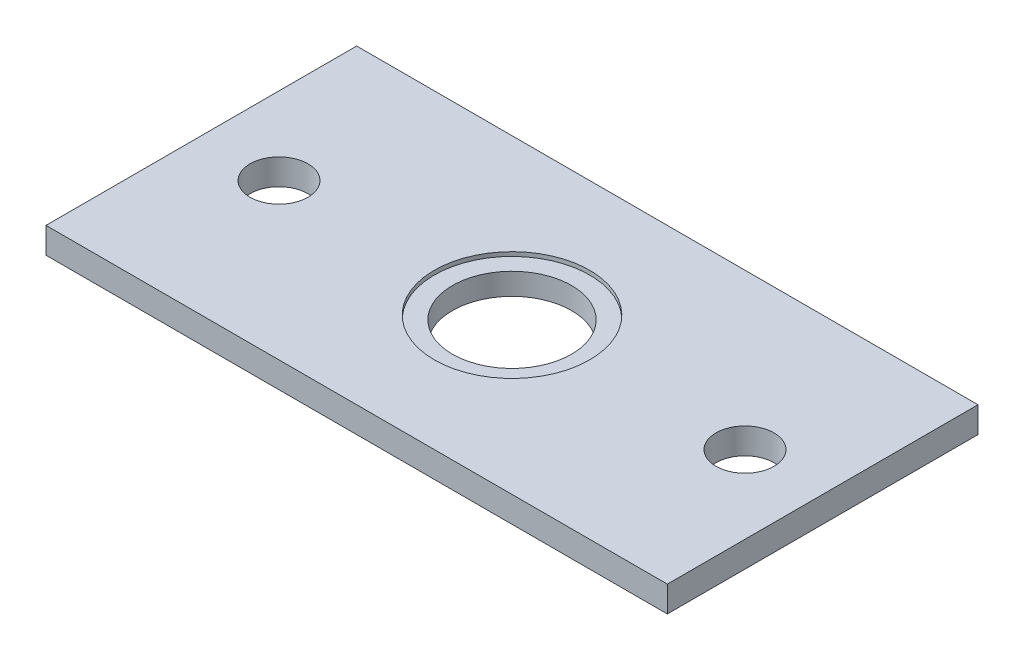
ISO-10303-21;
HEADER;
FILE_DESCRIPTION(('STEP AP214'),'2;1');
FILE_NAME('part.step','',(''),(''),'','','');
FILE_SCHEMA(('AUTOMOTIVE_DESIGN { 1 0 10303 214 1 1 1 1 }'));
ENDSEC;
DATA;
#1=APPLICATION_CONTEXT('core data for automotive mechanical design processes');
#2=APPLICATION_PROTOCOL_DEFINITION('international standard','automotive_design',2000,#1);
#3=PRODUCT_CONTEXT('',#1,'mechanical');
#4=PRODUCT('Part','Part','',(#3));
#5=PRODUCT_RELATED_PRODUCT_CATEGORY('part','',(#4));
#6=PRODUCT_DEFINITION_FORMATION('','',#4);
#7=PRODUCT_DEFINITION_CONTEXT('part definition',#1,'design');
#8=PRODUCT_DEFINITION('design','',#6,#7);
#9=PRODUCT_DEFINITION_SHAPE('','',#8);
#10=(LENGTH_UNIT() NAMED_UNIT(*) SI_UNIT(.MILLI.,.METRE.));
#11=(NAMED_UNIT(*) PLANE_ANGLE_UNIT() SI_UNIT($,.RADIAN.));
#12=(NAMED_UNIT(*) SI_UNIT($,.STERADIAN.) SOLID_ANGLE_UNIT());
#13=UNCERTAINTY_MEASURE_WITH_UNIT(LENGTH_MEASURE(1.E-05),#10,'distance_accuracy_value','');
#14=(GEOMETRIC_REPRESENTATION_CONTEXT(3) GLOBAL_UNCERTAINTY_ASSIGNED_CONTEXT((#13)) GLOBAL_UNIT_ASSIGNED_CONTEXT((#10,
#11,#12)) REPRESENTATION_CONTEXT('',''));
#15=CARTESIAN_POINT('',(0.,0.,0.));
#16=DIRECTION('',(0.,0.,1.));
#17=DIRECTION('',(1.,0.,0.));
#18=AXIS2_PLACEMENT_3D('',#15,#16,#17);
#19=CARTESIAN_POINT('',(38.1,0.,-19.05));
#20=DIRECTION('',(0.,1.,0.));
#21=DIRECTION('',(0.,0.,1.));
#22=AXIS2_PLACEMENT_3D('',#19,#20,#21);
#23=CYLINDRICAL_SURFACE('',#22,7.3025);
#24=CARTESIAN_POINT('',(38.1,0.,-19.05));
#25=DIRECTION('',(0.,1.,0.));
#26=DIRECTION('',(0.,0.,1.));
#27=AXIS2_PLACEMENT_3D('',#24,#25,#26);
#28=CIRCLE('',#27,7.3025);
#29=CARTESIAN_POINT('',(38.1,0.,-11.7475));
#30=VERTEX_POINT('',#29);
#31=EDGE_CURVE('E101',#30,#30,#28,.T.);
#32=ORIENTED_EDGE('',*,*,#31,.F.);
#33=EDGE_LOOP('',(#32));
#34=FACE_BOUND('',#33,.T.);
#35=CARTESIAN_POINT('',(38.1,2.667,-19.05));
#36=DIRECTION('',(0.,1.,0.));
#37=DIRECTION('',(0.,0.,1.));
#38=AXIS2_PLACEMENT_3D('',#35,#36,#37);
#39=CIRCLE('',#38,7.3025);
#40=CARTESIAN_POINT('',(38.1,2.667,-11.7475));
#41=VERTEX_POINT('',#40);
#42=EDGE_CURVE('E36',#41,#41,#39,.F.);
#43=ORIENTED_EDGE('',*,*,#42,.F.);
#44=EDGE_LOOP('',(#43));
#45=FACE_BOUND('',#44,.T.);
#46=ADVANCED_FACE('F32',(#34,#45),#23,.F.);
#47=CARTESIAN_POINT('',(0.,3.175,0.));
#48=DIRECTION('',(1.,0.,0.));
#49=DIRECTION('',(0.,0.,-1.));
#50=AXIS2_PLACEMENT_3D('',#47,#48,#49);
#51=PLANE('',#50);
#52=DIRECTION('',(0.,0.,1.));
#53=VECTOR('',#52,1.);
#54=CARTESIAN_POINT('',(0.,0.,0.));
#55=LINE('',#54,#53);
#56=CARTESIAN_POINT('',(0.,0.,-38.1));
#57=VERTEX_POINT('',#56);
#58=CARTESIAN_POINT('',(0.,0.,0.));
#59=VERTEX_POINT('',#58);
#60=EDGE_CURVE('E98',#57,#59,#55,.T.);
#61=ORIENTED_EDGE('',*,*,#60,.T.);
#62=DIRECTION('',(0.,-1.,0.));
#63=VECTOR('',#62,1.);
#64=CARTESIAN_POINT('',(0.,3.175,0.));
#65=LINE('',#64,#63);
#66=CARTESIAN_POINT('',(0.,3.175,0.));
#67=VERTEX_POINT('',#66);
#68=EDGE_CURVE('E11',#67,#59,#65,.T.);
#69=ORIENTED_EDGE('',*,*,#68,.F.);
#70=DIRECTION('',(0.,0.,1.));
#71=VECTOR('',#70,1.);
#72=CARTESIAN_POINT('',(0.,3.175,0.));
#73=LINE('',#72,#71);
#74=CARTESIAN_POINT('',(0.,3.175,-38.1));
#75=VERTEX_POINT('',#74);
#76=EDGE_CURVE('E85',#75,#67,#73,.T.);
#77=ORIENTED_EDGE('',*,*,#76,.F.);
#78=DIRECTION('',(0.,-1.,0.));
#79=VECTOR('',#78,1.);
#80=CARTESIAN_POINT('',(0.,3.175,-38.1));
#81=LINE('',#80,#79);
#82=EDGE_CURVE('E94',#75,#57,#81,.T.);
#83=ORIENTED_EDGE('',*,*,#82,.T.);
#84=EDGE_LOOP('',(#61,#69,#77,#83));
#85=FACE_BOUND('',#84,.T.);
#86=ADVANCED_FACE('F34',(#85),#51,.F.);
#87=CARTESIAN_POINT('',(0.,3.175,0.));
#88=DIRECTION('',(0.,0.,-1.));
#89=DIRECTION('',(-1.,0.,0.));
#90=AXIS2_PLACEMENT_3D('',#87,#88,#89);
#91=PLANE('',#90);
#92=DIRECTION('',(1.,0.,0.));
#93=VECTOR('',#92,1.);
#94=CARTESIAN_POINT('',(0.,0.,0.));
#95=LINE('',#94,#93);
#96=CARTESIAN_POINT('',(76.2,0.,0.));
#97=VERTEX_POINT('',#96);
#98=EDGE_CURVE('E89',#59,#97,#95,.T.);
#99=ORIENTED_EDGE('',*,*,#98,.T.);
#100=DIRECTION('',(0.,-1.,0.));
#101=VECTOR('',#100,1.);
#102=CARTESIAN_POINT('',(76.2,3.175,0.));
#103=LINE('',#102,#101);
#104=CARTESIAN_POINT('',(76.2,3.175,0.));
#105=VERTEX_POINT('',#104);
#106=EDGE_CURVE('E42',#105,#97,#103,.T.);
#107=ORIENTED_EDGE('',*,*,#106,.F.);
#108=DIRECTION('',(1.,0.,0.));
#109=VECTOR('',#108,1.);
#110=CARTESIAN_POINT('',(0.,3.175,0.));
#111=LINE('',#110,#109);
#112=EDGE_CURVE('E80',#67,#105,#111,.T.);
#113=ORIENTED_EDGE('',*,*,#112,.F.);
#114=ORIENTED_EDGE('',*,*,#68,.T.);
#115=EDGE_LOOP('',(#99,#107,#113,#114));
#116=FACE_BOUND('',#115,.T.);
#117=ADVANCED_FACE('F88',(#116),#91,.F.);
#118=CARTESIAN_POINT('',(76.2,3.175,0.));
#119=DIRECTION('',(-1.,0.,0.));
#120=DIRECTION('',(0.,0.,1.));
#121=AXIS2_PLACEMENT_3D('',#118,#119,#120);
#122=PLANE('',#121);
#123=DIRECTION('',(0.,0.,-1.));
#124=VECTOR('',#123,1.);
#125=CARTESIAN_POINT('',(76.2,0.,0.));
#126=LINE('',#125,#124);
#127=CARTESIAN_POINT('',(76.2,0.,-38.1));
#128=VERTEX_POINT('',#127);
#129=EDGE_CURVE('E67',#97,#128,#126,.T.);
#130=ORIENTED_EDGE('',*,*,#129,.T.);
#131=DIRECTION('',(0.,-1.,0.));
#132=VECTOR('',#131,1.);
#133=CARTESIAN_POINT('',(76.2,3.175,-38.1));
#134=LINE('',#133,#132);
#135=CARTESIAN_POINT('',(76.2,3.175,-38.1));
#136=VERTEX_POINT('',#135);
#137=EDGE_CURVE('E90',#136,#128,#134,.T.);
#138=ORIENTED_EDGE('',*,*,#137,.F.);
#139=DIRECTION('',(0.,0.,-1.));
#140=VECTOR('',#139,1.);
#141=CARTESIAN_POINT('',(76.2,3.175,0.));
#142=LINE('',#141,#140);
#143=EDGE_CURVE('E83',#105,#136,#142,.T.);
#144=ORIENTED_EDGE('',*,*,#143,.F.);
#145=ORIENTED_EDGE('',*,*,#106,.T.);
#146=EDGE_LOOP('',(#130,#138,#144,#145));
#147=FACE_BOUND('',#146,.T.);
#148=ADVANCED_FACE('F92',(#147),#122,.F.);
#149=CARTESIAN_POINT('',(0.,3.175,-38.1));
#150=DIRECTION('',(0.,0.,1.));
#151=DIRECTION('',(1.,0.,0.));
#152=AXIS2_PLACEMENT_3D('',#149,#150,#151);
#153=PLANE('',#152);
#154=DIRECTION('',(-1.,0.,0.));
#155=VECTOR('',#154,1.);
#156=CARTESIAN_POINT('',(0.,0.,-38.1));
#157=LINE('',#156,#155);
#158=EDGE_CURVE('E73',#128,#57,#157,.T.);
#159=ORIENTED_EDGE('',*,*,#158,.T.);
#160=ORIENTED_EDGE('',*,*,#82,.F.);
#161=DIRECTION('',(-1.,0.,0.));
#162=VECTOR('',#161,1.);
#163=CARTESIAN_POINT('',(0.,3.175,-38.1));
#164=LINE('',#163,#162);
#165=EDGE_CURVE('E50',#136,#75,#164,.T.);
#166=ORIENTED_EDGE('',*,*,#165,.F.);
#167=ORIENTED_EDGE('',*,*,#137,.T.);
#168=EDGE_LOOP('',(#159,#160,#166,#167));
#169=FACE_BOUND('',#168,.T.);
#170=ADVANCED_FACE('F106',(#169),#153,.F.);
#171=CARTESIAN_POINT('',(0.,3.175,-38.1));
#172=DIRECTION('',(0.,-1.,0.));
#173=DIRECTION('',(0.,0.,-1.));
#174=AXIS2_PLACEMENT_3D('',#171,#172,#173);
#175=PLANE('',#174);
#176=CARTESIAN_POINT('',(38.1,3.175,-19.05));
#177=DIRECTION('',(0.,1.,0.));
#178=DIRECTION('',(0.,0.,1.));
#179=AXIS2_PLACEMENT_3D('',#176,#177,#178);
#180=CIRCLE('',#179,9.525);
#181=CARTESIAN_POINT('',(38.1,3.175,-9.525));
#182=VERTEX_POINT('',#181);
#183=EDGE_CURVE('E126',#182,#182,#180,.T.);
#184=ORIENTED_EDGE('',*,*,#183,.F.);
#185=EDGE_LOOP('',(#184));
#186=FACE_BOUND('',#185,.T.);
#187=CARTESIAN_POINT('',(9.52500000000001,3.175,-19.05));
#188=DIRECTION('',(0.,1.,0.));
#189=DIRECTION('',(0.,0.,-1.));
#190=AXIS2_PLACEMENT_3D('',#187,#188,#189);
#191=CIRCLE('',#190,3.556);
#192=CARTESIAN_POINT('',(9.52500000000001,3.175,-22.606));
#193=VERTEX_POINT('',#192);
#194=EDGE_CURVE('E121',#193,#193,#191,.T.);
#195=ORIENTED_EDGE('',*,*,#194,.F.);
#196=EDGE_LOOP('',(#195));
#197=FACE_BOUND('',#196,.T.);
#198=CARTESIAN_POINT('',(66.675,3.175,-19.05));
#199=DIRECTION('',(0.,1.,0.));
#200=DIRECTION('',(0.,0.,1.));
#201=AXIS2_PLACEMENT_3D('',#198,#199,#200);
#202=CIRCLE('',#201,3.556);
#203=CARTESIAN_POINT('',(66.675,3.175,-15.494));
#204=VERTEX_POINT('',#203);
#205=EDGE_CURVE('E115',#204,#204,#202,.T.);
#206=ORIENTED_EDGE('',*,*,#205,.F.);
#207=EDGE_LOOP('',(#206));
#208=FACE_BOUND('',#207,.T.);
#209=ORIENTED_EDGE('',*,*,#76,.T.);
#210=ORIENTED_EDGE('',*,*,#112,.T.);
#211=ORIENTED_EDGE('',*,*,#143,.T.);
#212=ORIENTED_EDGE('',*,*,#165,.T.);
#213=EDGE_LOOP('',(#209,#210,#211,#212));
#214=FACE_BOUND('',#213,.T.);
#215=ADVANCED_FACE('F81',(#186,#197,#208,#214),#175,.F.);
#216=CARTESIAN_POINT('',(0.,0.,-38.1));
#217=DIRECTION('',(0.,-1.,0.));
#218=DIRECTION('',(0.,0.,-1.));
#219=AXIS2_PLACEMENT_3D('',#216,#217,#218);
#220=PLANE('',#219);
#221=CARTESIAN_POINT('',(9.52500000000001,0.,-19.05));
#222=DIRECTION('',(0.,1.,0.));
#223=DIRECTION('',(0.,0.,-1.));
#224=AXIS2_PLACEMENT_3D('',#221,#222,#223);
#225=CIRCLE('',#224,3.556);
#226=CARTESIAN_POINT('',(9.52500000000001,0.,-22.606));
#227=VERTEX_POINT('',#226);
#228=EDGE_CURVE('E118',#227,#227,#225,.T.);
#229=ORIENTED_EDGE('',*,*,#228,.T.);
#230=EDGE_LOOP('',(#229));
#231=FACE_BOUND('',#230,.T.);
#232=CARTESIAN_POINT('',(66.675,0.,-19.05));
#233=DIRECTION('',(0.,1.,0.));
#234=DIRECTION('',(0.,0.,1.));
#235=AXIS2_PLACEMENT_3D('',#232,#233,#234);
#236=CIRCLE('',#235,3.556);
#237=CARTESIAN_POINT('',(66.675,0.,-15.494));
#238=VERTEX_POINT('',#237);
#239=EDGE_CURVE('E114',#238,#238,#236,.T.);
#240=ORIENTED_EDGE('',*,*,#239,.T.);
#241=EDGE_LOOP('',(#240));
#242=FACE_BOUND('',#241,.T.);
#243=ORIENTED_EDGE('',*,*,#31,.T.);
#244=EDGE_LOOP('',(#243));
#245=FACE_BOUND('',#244,.T.);
#246=ORIENTED_EDGE('',*,*,#60,.F.);
#247=ORIENTED_EDGE('',*,*,#158,.F.);
#248=ORIENTED_EDGE('',*,*,#129,.F.);
#249=ORIENTED_EDGE('',*,*,#98,.F.);
#250=EDGE_LOOP('',(#246,#247,#248,#249));
#251=FACE_BOUND('',#250,.T.);
#252=ADVANCED_FACE('F109',(#231,#242,#245,#251),#220,.T.);
#253=CARTESIAN_POINT('',(66.675,0.,-19.05));
#254=DIRECTION('',(0.,1.,0.));
#255=DIRECTION('',(0.,0.,1.));
#256=AXIS2_PLACEMENT_3D('',#253,#254,#255);
#257=CYLINDRICAL_SURFACE('',#256,3.556);
#258=ORIENTED_EDGE('',*,*,#239,.F.);
#259=EDGE_LOOP('',(#258));
#260=FACE_BOUND('',#259,.T.);
#261=ORIENTED_EDGE('',*,*,#205,.T.);
#262=EDGE_LOOP('',(#261));
#263=FACE_BOUND('',#262,.T.);
#264=ADVANCED_FACE('F147',(#260,#263),#257,.F.);
#265=CARTESIAN_POINT('',(9.52500000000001,0.,-19.05));
#266=DIRECTION('',(0.,1.,0.));
#267=DIRECTION('',(0.,0.,1.));
#268=AXIS2_PLACEMENT_3D('',#265,#266,#267);
#269=CYLINDRICAL_SURFACE('',#268,3.556);
#270=ORIENTED_EDGE('',*,*,#228,.F.);
#271=EDGE_LOOP('',(#270));
#272=FACE_BOUND('',#271,.T.);
#273=ORIENTED_EDGE('',*,*,#194,.T.);
#274=EDGE_LOOP('',(#273));
#275=FACE_BOUND('',#274,.T.);
#276=ADVANCED_FACE('F186',(#272,#275),#269,.F.);
#277=CARTESIAN_POINT('',(38.1,2.667,-19.05));
#278=DIRECTION('',(0.,1.,0.));
#279=DIRECTION('',(0.,0.,1.));
#280=AXIS2_PLACEMENT_3D('',#277,#278,#279);
#281=PLANE('',#280);
#282=CARTESIAN_POINT('',(38.1,2.667,-19.05));
#283=DIRECTION('',(0.,1.,0.));
#284=DIRECTION('',(0.,0.,1.));
#285=AXIS2_PLACEMENT_3D('',#282,#283,#284);
#286=CIRCLE('',#285,9.525);
#287=CARTESIAN_POINT('',(38.1,2.667,-9.525));
#288=VERTEX_POINT('',#287);
#289=EDGE_CURVE('E129',#288,#288,#286,.T.);
#290=ORIENTED_EDGE('',*,*,#289,.T.);
#291=EDGE_LOOP('',(#290));
#292=FACE_BOUND('',#291,.T.);
#293=ORIENTED_EDGE('',*,*,#42,.T.);
#294=EDGE_LOOP('',(#293));
#295=FACE_BOUND('',#294,.T.);
#296=ADVANCED_FACE('F136',(#292,#295),#281,.T.);
#297=CARTESIAN_POINT('',(38.1,2.667,-19.05));
#298=DIRECTION('',(0.,1.,0.));
#299=DIRECTION('',(0.,0.,1.));
#300=AXIS2_PLACEMENT_3D('',#297,#298,#299);
#301=CYLINDRICAL_SURFACE('',#300,9.525);
#302=ORIENTED_EDGE('',*,*,#289,.F.);
#303=EDGE_LOOP('',(#302));
#304=FACE_BOUND('',#303,.T.);
#305=ORIENTED_EDGE('',*,*,#183,.T.);
#306=EDGE_LOOP('',(#305));
#307=FACE_BOUND('',#306,.T.);
#308=ADVANCED_FACE('F198',(#304,#307),#301,.F.);
#309=CLOSED_SHELL('',(#46,#86,#117,#148,#170,#215,#252,#264,#276,#296,#308));
#310=MANIFOLD_SOLID_BREP('B2',#309);
#311=ADVANCED_BREP_SHAPE_REPRESENTATION('',(#18,#310),#14);
#312=SHAPE_DEFINITION_REPRESENTATION(#9,#311);
ENDSEC;
END-ISO-10303-21;
